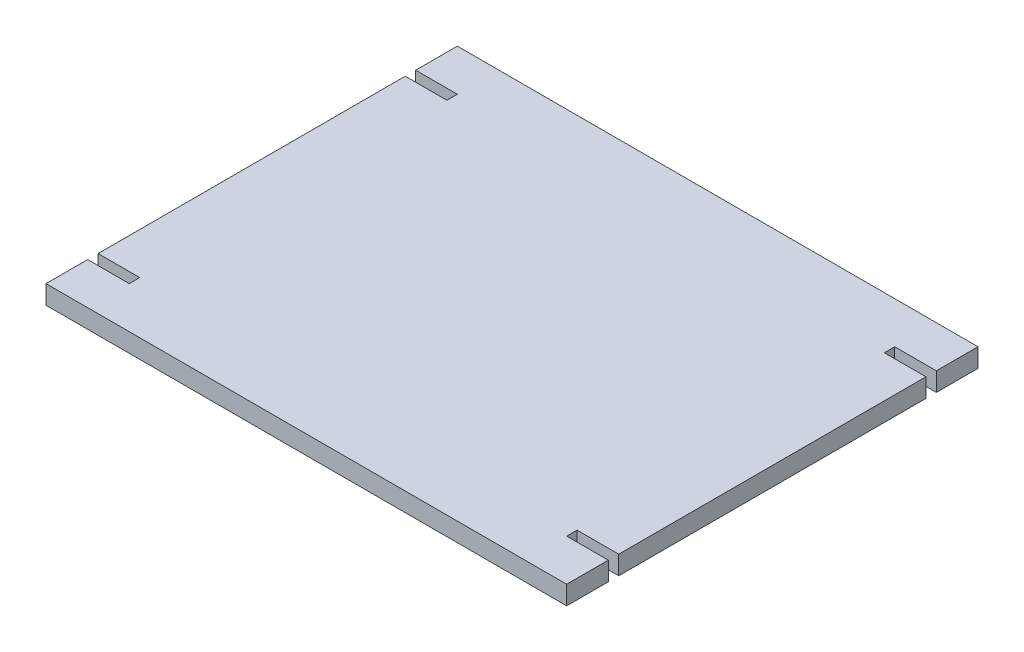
from build123d import *

# Parameters (mm, degrees)
BOSS_EXTRUDE1_DEPTH = 18


with BuildPart() as part:
    # Sketch1 → Boss-Extrude1 (new body)
    with BuildSketch(Plane(origin=(0, 0, 0), x_dir=(1, 0, 0), z_dir=(0, 1, 0))):
        Polygon((-301.875, 208.229166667), (198.125, 208.229166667), (198.125, 168.229166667), (158.125, 168.229166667), (158.125, 158.229166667), (198.125, 158.229166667), (198.125, -136.770833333), (158.125, -136.770833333), (158.125, -146.770833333), (198.125, -146.770833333), (198.125, -186.770833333), (-301.875, -186.770833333), (-301.875, -146.770833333), (-261.875, -146.770833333), (-261.875, -136.770833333), (-301.875, -136.770833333), (-301.875, 158.229166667), (-261.875, 158.229166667), (-261.875, 168.229166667), (-301.875, 168.229166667), align=None)
    extrude(amount=BOSS_EXTRUDE1_DEPTH)


solid = part.part
